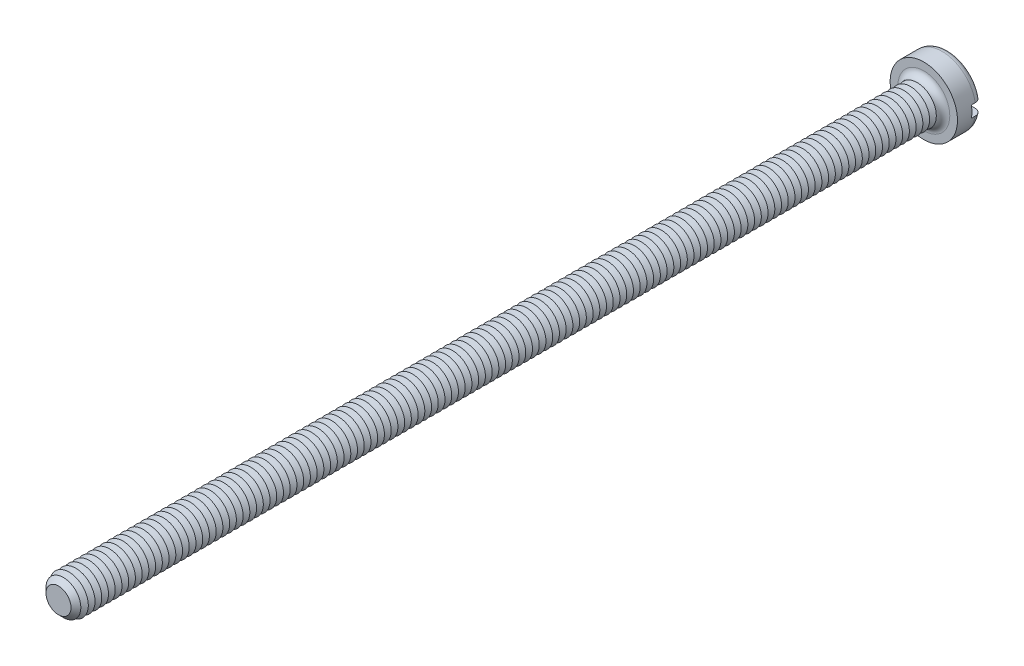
from build123d import *

# Parameters (mm, degrees)
SKETCH3_R           = 3.5
BOSS_EXTRUDE2_DEPTH = 2.6
SKETCH4_R           = 2
BOSS_EXTRUDE3_DEPTH = 90
FILLET1_R           = 0.7
CHAMFER1_SIZE       = 0.7
LPATTERN1_COUNT     = 127
LPATTERN1_PITCH     = 0.7
SKETCH8_W           = 7
SKETCH8_H           = 1.2
CUT_EXTRUDE1_DEPTH  = 1.1


with BuildPart() as part:
    # Sketch3 → Boss-Extrude2 (new body)
    with BuildSketch(Plane.XY):
        Circle(SKETCH3_R)
    extrude(amount=-BOSS_EXTRUDE2_DEPTH)

    # Sketch4 → Boss-Extrude3 (add)
    with BuildSketch(Plane.XY):
        with Locations(Location((0, 0, 0), (0, 0, 180))):
            Circle(SKETCH4_R)
    extrude(amount=BOSS_EXTRUDE3_DEPTH)

    # Fillet1
    fillet1_edges = [part.edges().sort_by_distance(p)[0] for p in [
        (-3.5, 0, -2.6),
        (2, 0, 0),
    ]]
    fillet(fillet1_edges, radius=FILLET1_R)

    # Chamfer1
    chamfer1_edges = [part.edges().sort_by_distance(p)[0] for p in [
        (2, 0, 90),
    ]]
    chamfer(chamfer1_edges, length=CHAMFER1_SIZE)

    # Sketch6 → Cut-Revolve1 (revolve, cut)
    with BuildSketch(Plane(origin=(0, 0, 0), x_dir=(0, 0, -1), z_dir=(1, 0, 0)), mode=Mode.PRIVATE) as cut_revolve1_sk:
        Polygon((-0.7, 2), (-1.05, 1.393782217), (-1.4, 2), align=None)
    cut_revolve1 = revolve(cut_revolve1_sk.sketch.rotate(Axis((0, 0, -1.694361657), (0, 0, 1)), 90), axis=Axis((0, 0, -1.694361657), (0, 0, 1)), mode=Mode.SUBTRACT)

    # LPattern1: Cut-Revolve1 ×127
    with Locations(*[(0, 0, i * LPATTERN1_PITCH) for i in range(1, LPATTERN1_COUNT)]):
        add(cut_revolve1, mode=Mode.SUBTRACT)

    # Sketch8 → Cut-Extrude1 (cut)
    with BuildSketch(Plane(origin=(0, 0, -2.6), x_dir=(-1, 0, 0), z_dir=(0, 0, -1))):
        Rectangle(SKETCH8_W, SKETCH8_H)
    extrude(amount=-CUT_EXTRUDE1_DEPTH, mode=Mode.SUBTRACT)


solid = part.part
